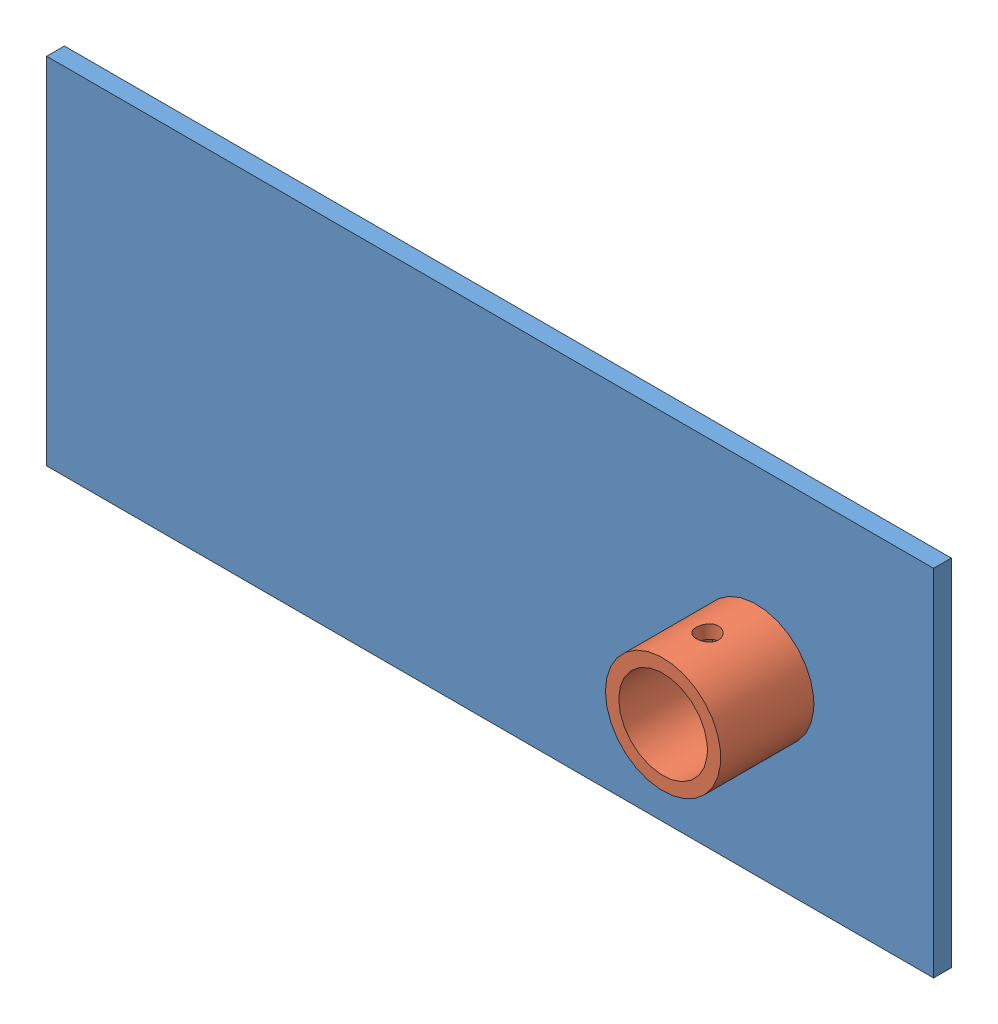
SolidWorks assembly Ancrage SUPERIEUR.SLDASM, configuration Défaut (file format 3100). Lengths in mm.
Overall size (200 80 25).
2 component instances, 2 part files, 3 mates.
Components (placement in the parent):
- Plaque d'ancrage SUPERIEURE-1: Plaque d'ancrage SUPERIEURE.SLDPRT [Défaut] at (-120.6874 -104.7826 0) size (200 80 4)
- Tube d'ancrage-1: Tube d'ancrage.SLDPRT [Défaut] at (39.3126 -64.7826 4) size (26 26 21)
Mates (geometry in assembly coordinates):
- Coïncidente1: coincident: plane of Plaque d'ancrage SUPERIEURE-1 through (-120.6874 -24.7826 4) normal (0 0 1); plane of Tube d'ancrage-1 through (-20.6874 -64.7826 4) normal (0 0 -1)
- Distance1: distance = 40 mm: axis of Tube d'ancrage-1; line of Plaque d'ancrage SUPERIEURE-1
- Distance2: distance = 40 mm: line of Plaque d'ancrage SUPERIEURE-1; axis of Tube d'ancrage-1
